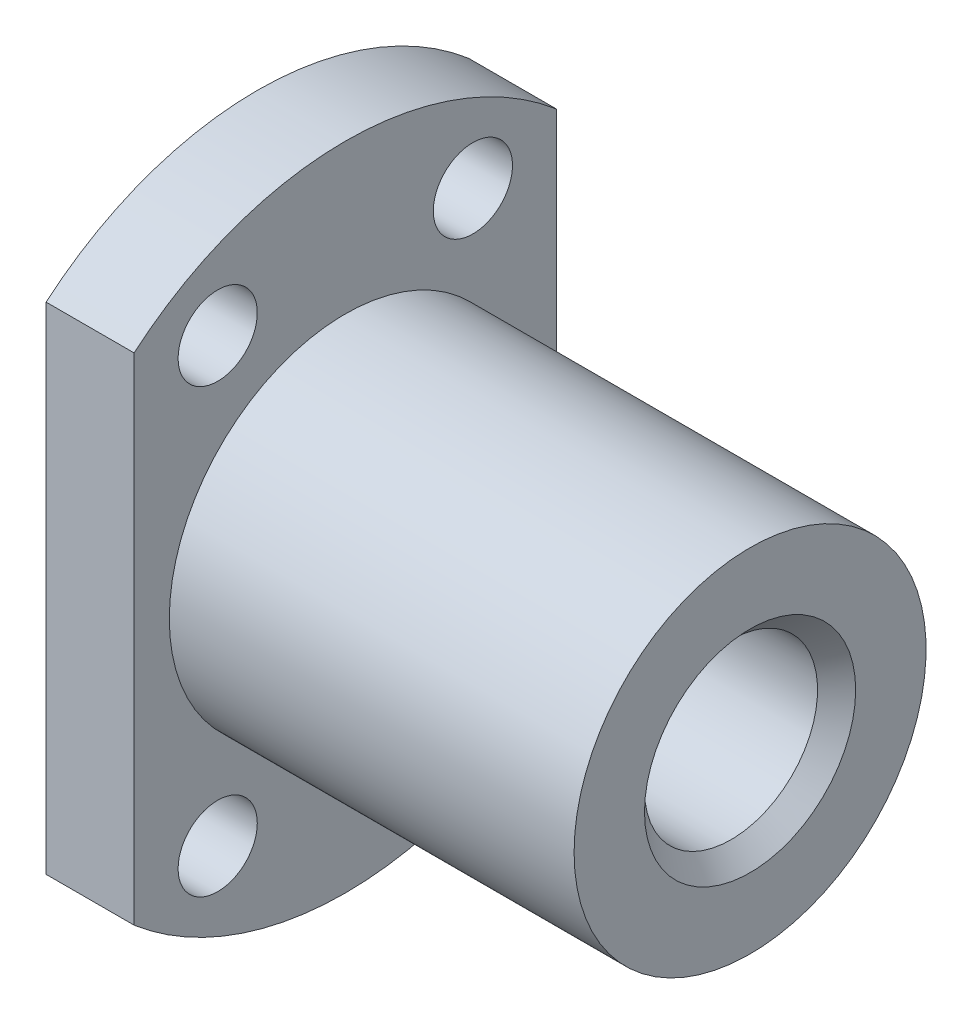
ISO-10303-21;
HEADER;
FILE_DESCRIPTION(('STEP AP214'),'2;1');
FILE_NAME('part.step','',(''),(''),'','','');
FILE_SCHEMA(('AUTOMOTIVE_DESIGN { 1 0 10303 214 1 1 1 1 }'));
ENDSEC;
DATA;
#1=APPLICATION_CONTEXT('core data for automotive mechanical design processes');
#2=APPLICATION_PROTOCOL_DEFINITION('international standard','automotive_design',2000,#1);
#3=PRODUCT_CONTEXT('',#1,'mechanical');
#4=PRODUCT('Part','Part','',(#3));
#5=PRODUCT_RELATED_PRODUCT_CATEGORY('part','',(#4));
#6=PRODUCT_DEFINITION_FORMATION('','',#4);
#7=PRODUCT_DEFINITION_CONTEXT('part definition',#1,'design');
#8=PRODUCT_DEFINITION('design','',#6,#7);
#9=PRODUCT_DEFINITION_SHAPE('','',#8);
#10=(LENGTH_UNIT() NAMED_UNIT(*) SI_UNIT(.MILLI.,.METRE.));
#11=(NAMED_UNIT(*) PLANE_ANGLE_UNIT() SI_UNIT($,.RADIAN.));
#12=(NAMED_UNIT(*) SI_UNIT($,.STERADIAN.) SOLID_ANGLE_UNIT());
#13=UNCERTAINTY_MEASURE_WITH_UNIT(LENGTH_MEASURE(1.E-05),#10,'distance_accuracy_value','');
#14=(GEOMETRIC_REPRESENTATION_CONTEXT(3) GLOBAL_UNCERTAINTY_ASSIGNED_CONTEXT((#13)) GLOBAL_UNIT_ASSIGNED_CONTEXT((#10,
#11,#12)) REPRESENTATION_CONTEXT('',''));
#15=CARTESIAN_POINT('',(0.,0.,0.));
#16=DIRECTION('',(0.,0.,1.));
#17=DIRECTION('',(1.,0.,0.));
#18=AXIS2_PLACEMENT_3D('',#15,#16,#17);
#19=CARTESIAN_POINT('',(0.,0.,0.));
#20=DIRECTION('',(-1.,0.,0.));
#21=DIRECTION('',(0.,0.,1.));
#22=AXIS2_PLACEMENT_3D('',#19,#20,#21);
#23=CYLINDRICAL_SURFACE('',#22,18.5);
#24=CARTESIAN_POINT('',(5.,0.,0.));
#25=DIRECTION('',(-1.,0.,0.));
#26=DIRECTION('',(0.,0.,1.));
#27=AXIS2_PLACEMENT_3D('',#24,#25,#26);
#28=CIRCLE('',#27,18.5);
#29=CARTESIAN_POINT('',(5.,14.0801278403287,12.));
#30=VERTEX_POINT('',#29);
#31=CARTESIAN_POINT('',(5.,14.0801278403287,-12.));
#32=VERTEX_POINT('',#31);
#33=EDGE_CURVE('E66',#30,#32,#28,.T.);
#34=ORIENTED_EDGE('',*,*,#33,.T.);
#35=DIRECTION('',(-1.,0.,0.));
#36=VECTOR('',#35,1.);
#37=CARTESIAN_POINT('',(0.,14.0801278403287,-12.));
#38=LINE('',#37,#36);
#39=CARTESIAN_POINT('',(0.,14.0801278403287,-12.));
#40=VERTEX_POINT('',#39);
#41=EDGE_CURVE('E56',#32,#40,#38,.T.);
#42=ORIENTED_EDGE('',*,*,#41,.T.);
#43=CARTESIAN_POINT('',(0.,0.,0.));
#44=DIRECTION('',(-1.,0.,0.));
#45=DIRECTION('',(0.,0.,1.));
#46=AXIS2_PLACEMENT_3D('',#43,#44,#45);
#47=CIRCLE('',#46,18.5);
#48=CARTESIAN_POINT('',(0.,14.0801278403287,12.));
#49=VERTEX_POINT('',#48);
#50=EDGE_CURVE('E64',#49,#40,#47,.T.);
#51=ORIENTED_EDGE('',*,*,#50,.F.);
#52=DIRECTION('',(-1.,0.,0.));
#53=VECTOR('',#52,1.);
#54=CARTESIAN_POINT('',(0.,14.0801278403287,12.));
#55=LINE('',#54,#53);
#56=EDGE_CURVE('E38',#49,#30,#55,.F.);
#57=ORIENTED_EDGE('',*,*,#56,.T.);
#58=EDGE_LOOP('',(#34,#42,#51,#57));
#59=FACE_BOUND('',#58,.T.);
#60=ADVANCED_FACE('F15',(#59),#23,.T.);
#61=CARTESIAN_POINT('',(0.,0.,0.));
#62=DIRECTION('',(-1.,0.,0.));
#63=DIRECTION('',(0.,0.,1.));
#64=AXIS2_PLACEMENT_3D('',#61,#62,#63);
#65=CONICAL_SURFACE('',#64,6.,0.78539816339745);
#66=CARTESIAN_POINT('',(1.0825,0.,0.));
#67=DIRECTION('',(-1.,0.,0.));
#68=DIRECTION('',(0.,0.,1.));
#69=AXIS2_PLACEMENT_3D('',#66,#67,#68);
#70=CIRCLE('',#69,4.9175);
#71=CARTESIAN_POINT('',(1.0825,0.,4.9175));
#72=VERTEX_POINT('',#71);
#73=EDGE_CURVE('E102',#72,#72,#70,.T.);
#74=ORIENTED_EDGE('',*,*,#73,.F.);
#75=EDGE_LOOP('',(#74));
#76=FACE_BOUND('',#75,.T.);
#77=CARTESIAN_POINT('',(0.,0.,0.));
#78=DIRECTION('',(-1.,0.,0.));
#79=DIRECTION('',(0.,0.,1.));
#80=AXIS2_PLACEMENT_3D('',#77,#78,#79);
#81=CIRCLE('',#80,6.);
#82=CARTESIAN_POINT('',(0.,0.,6.));
#83=VERTEX_POINT('',#82);
#84=EDGE_CURVE('E81',#83,#83,#81,.T.);
#85=ORIENTED_EDGE('',*,*,#84,.T.);
#86=EDGE_LOOP('',(#85));
#87=FACE_BOUND('',#86,.T.);
#88=ADVANCED_FACE('F17',(#76,#87),#65,.F.);
#89=CARTESIAN_POINT('',(0.,0.,0.));
#90=DIRECTION('',(-1.,0.,0.));
#91=DIRECTION('',(0.,0.,1.));
#92=AXIS2_PLACEMENT_3D('',#89,#90,#91);
#93=CYLINDRICAL_SURFACE('',#92,4.9175);
#94=CARTESIAN_POINT('',(26.9175,0.,0.));
#95=DIRECTION('',(-1.,0.,0.));
#96=DIRECTION('',(0.,0.,1.));
#97=AXIS2_PLACEMENT_3D('',#94,#95,#96);
#98=CIRCLE('',#97,4.9175);
#99=CARTESIAN_POINT('',(26.9175,0.,4.9175));
#100=VERTEX_POINT('',#99);
#101=EDGE_CURVE('E98',#100,#100,#98,.T.);
#102=ORIENTED_EDGE('',*,*,#101,.F.);
#103=EDGE_LOOP('',(#102));
#104=FACE_BOUND('',#103,.T.);
#105=ORIENTED_EDGE('',*,*,#73,.T.);
#106=EDGE_LOOP('',(#105));
#107=FACE_BOUND('',#106,.T.);
#108=ADVANCED_FACE('F243',(#104,#107),#93,.F.);
#109=CARTESIAN_POINT('',(26.9175,0.,0.));
#110=DIRECTION('',(1.,0.,0.));
#111=DIRECTION('',(0.,0.,-1.));
#112=AXIS2_PLACEMENT_3D('',#109,#110,#111);
#113=CONICAL_SURFACE('',#112,4.9175,0.785398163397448);
#114=CARTESIAN_POINT('',(28.,0.,0.));
#115=DIRECTION('',(-1.,0.,0.));
#116=DIRECTION('',(0.,0.,1.));
#117=AXIS2_PLACEMENT_3D('',#114,#115,#116);
#118=CIRCLE('',#117,6.);
#119=CARTESIAN_POINT('',(28.,0.,6.));
#120=VERTEX_POINT('',#119);
#121=EDGE_CURVE('E94',#120,#120,#118,.T.);
#122=ORIENTED_EDGE('',*,*,#121,.F.);
#123=EDGE_LOOP('',(#122));
#124=FACE_BOUND('',#123,.T.);
#125=ORIENTED_EDGE('',*,*,#101,.T.);
#126=EDGE_LOOP('',(#125));
#127=FACE_BOUND('',#126,.T.);
#128=ADVANCED_FACE('F234',(#124,#127),#113,.F.);
#129=CARTESIAN_POINT('',(28.,6.,0.));
#130=DIRECTION('',(-1.,0.,0.));
#131=DIRECTION('',(0.,0.,1.));
#132=AXIS2_PLACEMENT_3D('',#129,#130,#131);
#133=PLANE('',#132);
#134=CARTESIAN_POINT('',(28.,0.,0.));
#135=DIRECTION('',(-1.,0.,0.));
#136=DIRECTION('',(0.,0.,1.));
#137=AXIS2_PLACEMENT_3D('',#134,#135,#136);
#138=CIRCLE('',#137,10.);
#139=CARTESIAN_POINT('',(28.,0.,10.));
#140=VERTEX_POINT('',#139);
#141=EDGE_CURVE('E90',#140,#140,#138,.T.);
#142=ORIENTED_EDGE('',*,*,#141,.F.);
#143=EDGE_LOOP('',(#142));
#144=FACE_BOUND('',#143,.T.);
#145=ORIENTED_EDGE('',*,*,#121,.T.);
#146=EDGE_LOOP('',(#145));
#147=FACE_BOUND('',#146,.T.);
#148=ADVANCED_FACE('F225',(#144,#147),#133,.F.);
#149=CARTESIAN_POINT('',(0.,0.,0.));
#150=DIRECTION('',(-1.,0.,0.));
#151=DIRECTION('',(0.,0.,1.));
#152=AXIS2_PLACEMENT_3D('',#149,#150,#151);
#153=CYLINDRICAL_SURFACE('',#152,10.);
#154=CARTESIAN_POINT('',(5.,0.,0.));
#155=DIRECTION('',(-1.,0.,0.));
#156=DIRECTION('',(0.,0.,1.));
#157=AXIS2_PLACEMENT_3D('',#154,#155,#156);
#158=CIRCLE('',#157,10.);
#159=CARTESIAN_POINT('',(5.,0.,10.));
#160=VERTEX_POINT('',#159);
#161=EDGE_CURVE('E86',#160,#160,#158,.T.);
#162=ORIENTED_EDGE('',*,*,#161,.F.);
#163=EDGE_LOOP('',(#162));
#164=FACE_BOUND('',#163,.T.);
#165=ORIENTED_EDGE('',*,*,#141,.T.);
#166=EDGE_LOOP('',(#165));
#167=FACE_BOUND('',#166,.T.);
#168=ADVANCED_FACE('F216',(#164,#167),#153,.T.);
#169=CARTESIAN_POINT('',(5.,10.,0.));
#170=DIRECTION('',(-1.,0.,0.));
#171=DIRECTION('',(0.,0.,1.));
#172=AXIS2_PLACEMENT_3D('',#169,#170,#171);
#173=PLANE('',#172);
#174=CARTESIAN_POINT('',(5.,12.5573683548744,-7.25));
#175=DIRECTION('',(-1.,0.,0.));
#176=DIRECTION('',(0.,0.,1.));
#177=AXIS2_PLACEMENT_3D('',#174,#175,#176);
#178=CIRCLE('',#177,2.25);
#179=CARTESIAN_POINT('',(5.,12.5573683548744,-5.));
#180=VERTEX_POINT('',#179);
#181=EDGE_CURVE('E121',#180,#180,#178,.T.);
#182=ORIENTED_EDGE('',*,*,#181,.T.);
#183=EDGE_LOOP('',(#182));
#184=FACE_BOUND('',#183,.T.);
#185=CARTESIAN_POINT('',(5.,12.5573683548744,7.25));
#186=DIRECTION('',(-1.,0.,0.));
#187=DIRECTION('',(0.,0.,1.));
#188=AXIS2_PLACEMENT_3D('',#185,#186,#187);
#189=CIRCLE('',#188,2.25);
#190=CARTESIAN_POINT('',(5.,12.5573683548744,9.5));
#191=VERTEX_POINT('',#190);
#192=EDGE_CURVE('E116',#191,#191,#189,.T.);
#193=ORIENTED_EDGE('',*,*,#192,.T.);
#194=EDGE_LOOP('',(#193));
#195=FACE_BOUND('',#194,.T.);
#196=CARTESIAN_POINT('',(5.,-12.5573683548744,-7.25));
#197=DIRECTION('',(-1.,0.,0.));
#198=DIRECTION('',(0.,0.,1.));
#199=AXIS2_PLACEMENT_3D('',#196,#197,#198);
#200=CIRCLE('',#199,2.25);
#201=CARTESIAN_POINT('',(5.,-12.5573683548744,-5.));
#202=VERTEX_POINT('',#201);
#203=EDGE_CURVE('E111',#202,#202,#200,.T.);
#204=ORIENTED_EDGE('',*,*,#203,.T.);
#205=EDGE_LOOP('',(#204));
#206=FACE_BOUND('',#205,.T.);
#207=CARTESIAN_POINT('',(5.,-12.5573683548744,7.25));
#208=DIRECTION('',(-1.,0.,0.));
#209=DIRECTION('',(0.,0.,1.));
#210=AXIS2_PLACEMENT_3D('',#207,#208,#209);
#211=CIRCLE('',#210,2.25);
#212=CARTESIAN_POINT('',(5.,-12.5573683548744,9.5));
#213=VERTEX_POINT('',#212);
#214=EDGE_CURVE('E110',#213,#213,#211,.T.);
#215=ORIENTED_EDGE('',*,*,#214,.T.);
#216=EDGE_LOOP('',(#215));
#217=FACE_BOUND('',#216,.T.);
#218=CARTESIAN_POINT('',(5.,-14.0801278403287,-12.));
#219=VERTEX_POINT('',#218);
#220=CARTESIAN_POINT('',(5.,-14.0801278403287,12.));
#221=VERTEX_POINT('',#220);
#222=EDGE_CURVE('E72',#219,#221,#28,.T.);
#223=ORIENTED_EDGE('',*,*,#222,.F.);
#224=DIRECTION('',(0.,1.,0.));
#225=VECTOR('',#224,1.);
#226=CARTESIAN_POINT('',(5.,10.,-12.));
#227=LINE('',#226,#225);
#228=EDGE_CURVE('E68',#219,#32,#227,.T.);
#229=ORIENTED_EDGE('',*,*,#228,.T.);
#230=ORIENTED_EDGE('',*,*,#33,.F.);
#231=DIRECTION('',(0.,-1.,0.));
#232=VECTOR('',#231,1.);
#233=CARTESIAN_POINT('',(5.,10.,12.));
#234=LINE('',#233,#232);
#235=EDGE_CURVE('E125',#30,#221,#234,.T.);
#236=ORIENTED_EDGE('',*,*,#235,.T.);
#237=EDGE_LOOP('',(#223,#229,#230,#236));
#238=FACE_BOUND('',#237,.T.);
#239=ORIENTED_EDGE('',*,*,#161,.T.);
#240=EDGE_LOOP('',(#239));
#241=FACE_BOUND('',#240,.T.);
#242=ADVANCED_FACE('F207',(#184,#195,#206,#217,#238,#241),#173,.F.);
#243=CARTESIAN_POINT('',(0.,-14.0801278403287,-12.));
#244=VERTEX_POINT('',#243);
#245=CARTESIAN_POINT('',(0.,-14.0801278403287,12.));
#246=VERTEX_POINT('',#245);
#247=EDGE_CURVE('E73',#244,#246,#47,.T.);
#248=ORIENTED_EDGE('',*,*,#247,.F.);
#249=DIRECTION('',(-1.,0.,0.));
#250=VECTOR('',#249,1.);
#251=CARTESIAN_POINT('',(0.,-14.0801278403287,-12.));
#252=LINE('',#251,#250);
#253=EDGE_CURVE('E31',#244,#219,#252,.F.);
#254=ORIENTED_EDGE('',*,*,#253,.T.);
#255=ORIENTED_EDGE('',*,*,#222,.T.);
#256=DIRECTION('',(-1.,0.,0.));
#257=VECTOR('',#256,1.);
#258=CARTESIAN_POINT('',(0.,-14.0801278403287,12.));
#259=LINE('',#258,#257);
#260=EDGE_CURVE('E308',#221,#246,#259,.T.);
#261=ORIENTED_EDGE('',*,*,#260,.T.);
#262=EDGE_LOOP('',(#248,#254,#255,#261));
#263=FACE_BOUND('',#262,.T.);
#264=ADVANCED_FACE('F198',(#263),#23,.T.);
#265=CARTESIAN_POINT('',(0.,18.5,0.));
#266=DIRECTION('',(1.,0.,0.));
#267=DIRECTION('',(0.,0.,-1.));
#268=AXIS2_PLACEMENT_3D('',#265,#266,#267);
#269=PLANE('',#268);
#270=CARTESIAN_POINT('',(0.,12.5573683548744,-7.25));
#271=DIRECTION('',(1.,0.,0.));
#272=DIRECTION('',(0.,0.,-1.));
#273=AXIS2_PLACEMENT_3D('',#270,#271,#272);
#274=CIRCLE('',#273,2.25);
#275=CARTESIAN_POINT('',(0.,12.5573683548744,-9.5));
#276=VERTEX_POINT('',#275);
#277=EDGE_CURVE('E122',#276,#276,#274,.T.);
#278=ORIENTED_EDGE('',*,*,#277,.T.);
#279=EDGE_LOOP('',(#278));
#280=FACE_BOUND('',#279,.T.);
#281=CARTESIAN_POINT('',(0.,12.5573683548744,7.25));
#282=DIRECTION('',(1.,0.,0.));
#283=DIRECTION('',(0.,0.,-1.));
#284=AXIS2_PLACEMENT_3D('',#281,#282,#283);
#285=CIRCLE('',#284,2.25);
#286=CARTESIAN_POINT('',(0.,12.5573683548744,5.));
#287=VERTEX_POINT('',#286);
#288=EDGE_CURVE('E117',#287,#287,#285,.T.);
#289=ORIENTED_EDGE('',*,*,#288,.T.);
#290=EDGE_LOOP('',(#289));
#291=FACE_BOUND('',#290,.T.);
#292=CARTESIAN_POINT('',(0.,-12.5573683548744,-7.25));
#293=DIRECTION('',(1.,0.,0.));
#294=DIRECTION('',(0.,0.,-1.));
#295=AXIS2_PLACEMENT_3D('',#292,#293,#294);
#296=CIRCLE('',#295,2.25);
#297=CARTESIAN_POINT('',(0.,-12.5573683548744,-9.5));
#298=VERTEX_POINT('',#297);
#299=EDGE_CURVE('E112',#298,#298,#296,.T.);
#300=ORIENTED_EDGE('',*,*,#299,.T.);
#301=EDGE_LOOP('',(#300));
#302=FACE_BOUND('',#301,.T.);
#303=CARTESIAN_POINT('',(0.,-12.5573683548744,7.25));
#304=DIRECTION('',(1.,0.,0.));
#305=DIRECTION('',(0.,0.,-1.));
#306=AXIS2_PLACEMENT_3D('',#303,#304,#305);
#307=CIRCLE('',#306,2.25);
#308=CARTESIAN_POINT('',(0.,-12.5573683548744,5.));
#309=VERTEX_POINT('',#308);
#310=EDGE_CURVE('E106',#309,#309,#307,.T.);
#311=ORIENTED_EDGE('',*,*,#310,.T.);
#312=EDGE_LOOP('',(#311));
#313=FACE_BOUND('',#312,.T.);
#314=ORIENTED_EDGE('',*,*,#84,.F.);
#315=EDGE_LOOP('',(#314));
#316=FACE_BOUND('',#315,.T.);
#317=ORIENTED_EDGE('',*,*,#50,.T.);
#318=DIRECTION('',(0.,-1.,0.));
#319=VECTOR('',#318,1.);
#320=CARTESIAN_POINT('',(0.,18.5,-12.));
#321=LINE('',#320,#319);
#322=EDGE_CURVE('E10',#40,#244,#321,.T.);
#323=ORIENTED_EDGE('',*,*,#322,.T.);
#324=ORIENTED_EDGE('',*,*,#247,.T.);
#325=DIRECTION('',(0.,1.,0.));
#326=VECTOR('',#325,1.);
#327=CARTESIAN_POINT('',(0.,18.5,12.));
#328=LINE('',#327,#326);
#329=EDGE_CURVE('E24',#246,#49,#328,.T.);
#330=ORIENTED_EDGE('',*,*,#329,.T.);
#331=EDGE_LOOP('',(#317,#323,#324,#330));
#332=FACE_BOUND('',#331,.T.);
#333=ADVANCED_FACE('F70',(#280,#291,#302,#313,#316,#332),#269,.F.);
#334=CARTESIAN_POINT('',(-1.,-12.5573683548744,7.25));
#335=DIRECTION('',(1.,0.,0.));
#336=DIRECTION('',(0.,-0.5,-0.866025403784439));
#337=AXIS2_PLACEMENT_3D('',#334,#335,#336);
#338=CYLINDRICAL_SURFACE('',#337,2.25);
#339=ORIENTED_EDGE('',*,*,#310,.F.);
#340=EDGE_LOOP('',(#339));
#341=FACE_BOUND('',#340,.T.);
#342=ORIENTED_EDGE('',*,*,#214,.F.);
#343=EDGE_LOOP('',(#342));
#344=FACE_BOUND('',#343,.T.);
#345=ADVANCED_FACE('F132',(#341,#344),#338,.F.);
#346=CARTESIAN_POINT('',(-1.,-12.5573683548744,-7.25));
#347=DIRECTION('',(1.,0.,0.));
#348=DIRECTION('',(0.,0.5,-0.866025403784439));
#349=AXIS2_PLACEMENT_3D('',#346,#347,#348);
#350=CYLINDRICAL_SURFACE('',#349,2.25);
#351=ORIENTED_EDGE('',*,*,#299,.F.);
#352=EDGE_LOOP('',(#351));
#353=FACE_BOUND('',#352,.T.);
#354=ORIENTED_EDGE('',*,*,#203,.F.);
#355=EDGE_LOOP('',(#354));
#356=FACE_BOUND('',#355,.T.);
#357=ADVANCED_FACE('F137',(#353,#356),#350,.F.);
#358=CARTESIAN_POINT('',(-1.,12.5573683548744,7.25));
#359=DIRECTION('',(1.,0.,0.));
#360=DIRECTION('',(0.,-0.5,0.866025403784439));
#361=AXIS2_PLACEMENT_3D('',#358,#359,#360);
#362=CYLINDRICAL_SURFACE('',#361,2.25);
#363=ORIENTED_EDGE('',*,*,#288,.F.);
#364=EDGE_LOOP('',(#363));
#365=FACE_BOUND('',#364,.T.);
#366=ORIENTED_EDGE('',*,*,#192,.F.);
#367=EDGE_LOOP('',(#366));
#368=FACE_BOUND('',#367,.T.);
#369=ADVANCED_FACE('F148',(#365,#368),#362,.F.);
#370=CARTESIAN_POINT('',(-1.,12.5573683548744,-7.25));
#371=DIRECTION('',(1.,0.,0.));
#372=DIRECTION('',(0.,0.5,0.866025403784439));
#373=AXIS2_PLACEMENT_3D('',#370,#371,#372);
#374=CYLINDRICAL_SURFACE('',#373,2.25);
#375=ORIENTED_EDGE('',*,*,#277,.F.);
#376=EDGE_LOOP('',(#375));
#377=FACE_BOUND('',#376,.T.);
#378=ORIENTED_EDGE('',*,*,#181,.F.);
#379=EDGE_LOOP('',(#378));
#380=FACE_BOUND('',#379,.T.);
#381=ADVANCED_FACE('F157',(#377,#380),#374,.F.);
#382=CARTESIAN_POINT('',(14.,0.,12.));
#383=DIRECTION('',(0.,0.,-1.));
#384=DIRECTION('',(-1.,0.,0.));
#385=AXIS2_PLACEMENT_3D('',#382,#383,#384);
#386=PLANE('',#385);
#387=ORIENTED_EDGE('',*,*,#56,.F.);
#388=ORIENTED_EDGE('',*,*,#329,.F.);
#389=ORIENTED_EDGE('',*,*,#260,.F.);
#390=ORIENTED_EDGE('',*,*,#235,.F.);
#391=EDGE_LOOP('',(#387,#388,#389,#390));
#392=FACE_BOUND('',#391,.T.);
#393=ADVANCED_FACE('F166',(#392),#386,.F.);
#394=CARTESIAN_POINT('',(14.,0.,-12.));
#395=DIRECTION('',(0.,0.,1.));
#396=DIRECTION('',(-1.,0.,0.));
#397=AXIS2_PLACEMENT_3D('',#394,#395,#396);
#398=PLANE('',#397);
#399=ORIENTED_EDGE('',*,*,#253,.F.);
#400=ORIENTED_EDGE('',*,*,#322,.F.);
#401=ORIENTED_EDGE('',*,*,#41,.F.);
#402=ORIENTED_EDGE('',*,*,#228,.F.);
#403=EDGE_LOOP('',(#399,#400,#401,#402));
#404=FACE_BOUND('',#403,.T.);
#405=ADVANCED_FACE('F55',(#404),#398,.F.);
#406=CLOSED_SHELL('',(#60,#88,#108,#128,#148,#168,#242,#264,#333,#345,#357,#369,#381,#393,#405));
#407=MANIFOLD_SOLID_BREP('B1',#406);
#408=ADVANCED_BREP_SHAPE_REPRESENTATION('',(#18,#407),#14);
#409=SHAPE_DEFINITION_REPRESENTATION(#9,#408);
ENDSEC;
END-ISO-10303-21;
